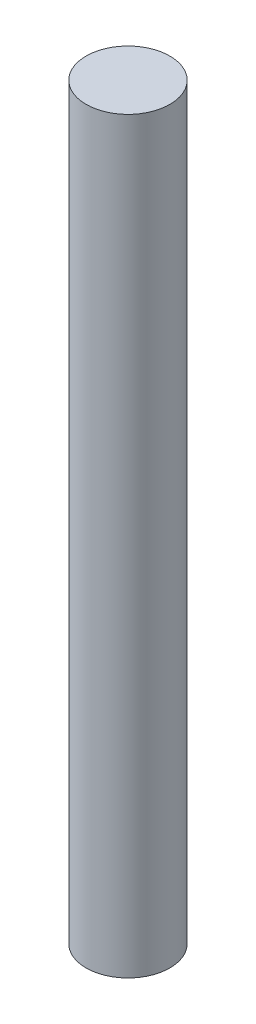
ISO-10303-21;
HEADER;
FILE_DESCRIPTION(('STEP AP214'),'2;1');
FILE_NAME('part.step','',(''),(''),'','','');
FILE_SCHEMA(('AUTOMOTIVE_DESIGN { 1 0 10303 214 1 1 1 1 }'));
ENDSEC;
DATA;
#1=APPLICATION_CONTEXT('core data for automotive mechanical design processes');
#2=APPLICATION_PROTOCOL_DEFINITION('international standard','automotive_design',2000,#1);
#3=PRODUCT_CONTEXT('',#1,'mechanical');
#4=PRODUCT('Part','Part','',(#3));
#5=PRODUCT_RELATED_PRODUCT_CATEGORY('part','',(#4));
#6=PRODUCT_DEFINITION_FORMATION('','',#4);
#7=PRODUCT_DEFINITION_CONTEXT('part definition',#1,'design');
#8=PRODUCT_DEFINITION('design','',#6,#7);
#9=PRODUCT_DEFINITION_SHAPE('','',#8);
#10=(LENGTH_UNIT() NAMED_UNIT(*) SI_UNIT(.MILLI.,.METRE.));
#11=(NAMED_UNIT(*) PLANE_ANGLE_UNIT() SI_UNIT($,.RADIAN.));
#12=(NAMED_UNIT(*) SI_UNIT($,.STERADIAN.) SOLID_ANGLE_UNIT());
#13=UNCERTAINTY_MEASURE_WITH_UNIT(LENGTH_MEASURE(1.E-05),#10,'distance_accuracy_value','');
#14=(GEOMETRIC_REPRESENTATION_CONTEXT(3) GLOBAL_UNCERTAINTY_ASSIGNED_CONTEXT((#13)) GLOBAL_UNIT_ASSIGNED_CONTEXT((#10,
#11,#12)) REPRESENTATION_CONTEXT('',''));
#15=CARTESIAN_POINT('',(0.,0.,0.));
#16=DIRECTION('',(0.,0.,1.));
#17=DIRECTION('',(1.,0.,0.));
#18=AXIS2_PLACEMENT_3D('',#15,#16,#17);
#19=CARTESIAN_POINT('',(0.,25.4,0.));
#20=DIRECTION('',(0.,-1.,0.));
#21=DIRECTION('',(0.,0.,-1.));
#22=AXIS2_PLACEMENT_3D('',#19,#20,#21);
#23=CYLINDRICAL_SURFACE('',#22,1.4224);
#24=CARTESIAN_POINT('',(0.,25.4,0.));
#25=DIRECTION('',(0.,1.,0.));
#26=DIRECTION('',(0.,0.,1.));
#27=AXIS2_PLACEMENT_3D('',#24,#25,#26);
#28=CIRCLE('',#27,1.4224);
#29=CARTESIAN_POINT('',(0.,25.4,1.4224));
#30=VERTEX_POINT('',#29);
#31=EDGE_CURVE('E10',#30,#30,#28,.T.);
#32=ORIENTED_EDGE('',*,*,#31,.F.);
#33=EDGE_LOOP('',(#32));
#34=FACE_BOUND('',#33,.T.);
#35=CARTESIAN_POINT('',(0.,0.,0.));
#36=DIRECTION('',(0.,1.,0.));
#37=DIRECTION('',(0.,0.,1.));
#38=AXIS2_PLACEMENT_3D('',#35,#36,#37);
#39=CIRCLE('',#38,1.4224);
#40=CARTESIAN_POINT('',(0.,0.,1.4224));
#41=VERTEX_POINT('',#40);
#42=EDGE_CURVE('E33',#41,#41,#39,.T.);
#43=ORIENTED_EDGE('',*,*,#42,.T.);
#44=EDGE_LOOP('',(#43));
#45=FACE_BOUND('',#44,.T.);
#46=ADVANCED_FACE('F30',(#34,#45),#23,.T.);
#47=CARTESIAN_POINT('',(0.,25.4,0.));
#48=DIRECTION('',(0.,1.,0.));
#49=DIRECTION('',(0.,0.,1.));
#50=AXIS2_PLACEMENT_3D('',#47,#48,#49);
#51=PLANE('',#50);
#52=ORIENTED_EDGE('',*,*,#31,.T.);
#53=EDGE_LOOP('',(#52));
#54=FACE_BOUND('',#53,.T.);
#55=ADVANCED_FACE('F45',(#54),#51,.T.);
#56=CARTESIAN_POINT('',(0.,0.,0.));
#57=DIRECTION('',(0.,1.,0.));
#58=DIRECTION('',(0.,0.,1.));
#59=AXIS2_PLACEMENT_3D('',#56,#57,#58);
#60=PLANE('',#59);
#61=ORIENTED_EDGE('',*,*,#42,.F.);
#62=EDGE_LOOP('',(#61));
#63=FACE_BOUND('',#62,.T.);
#64=ADVANCED_FACE('F43',(#63),#60,.F.);
#65=CLOSED_SHELL('',(#46,#55,#64));
#66=MANIFOLD_SOLID_BREP('B2',#65);
#67=ADVANCED_BREP_SHAPE_REPRESENTATION('',(#18,#66),#14);
#68=SHAPE_DEFINITION_REPRESENTATION(#9,#67);
ENDSEC;
END-ISO-10303-21;
